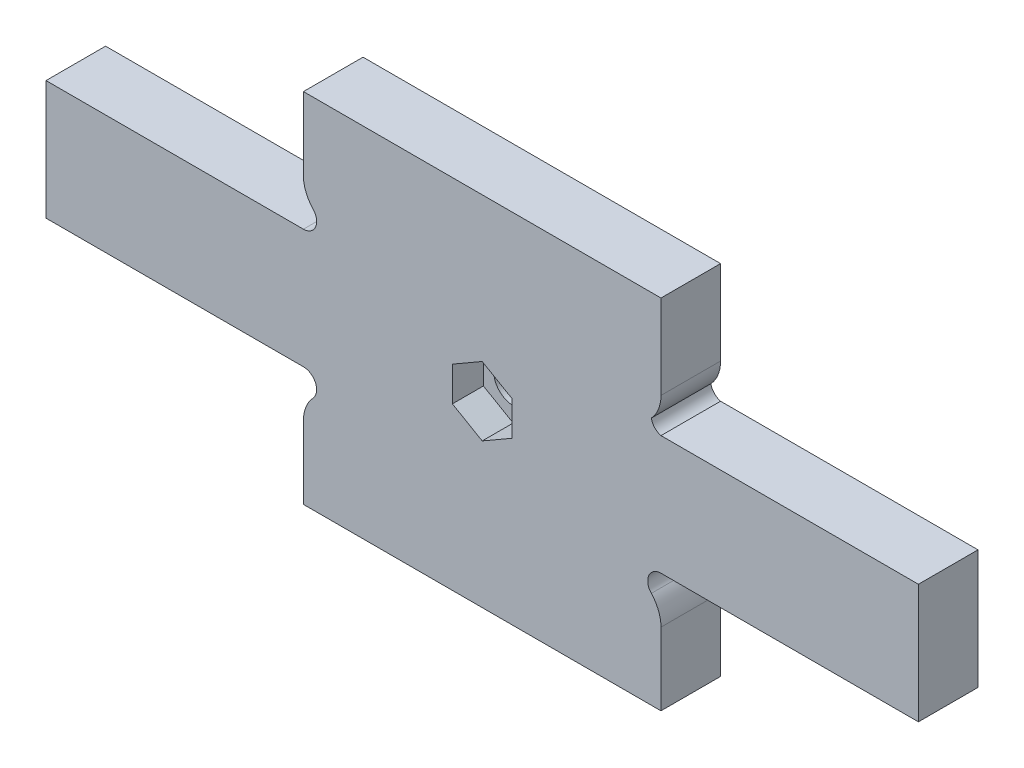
ISO-10303-21;
HEADER;
FILE_DESCRIPTION(('STEP AP214'),'2;1');
FILE_NAME('part.step','',(''),(''),'','','');
FILE_SCHEMA(('AUTOMOTIVE_DESIGN { 1 0 10303 214 1 1 1 1 }'));
ENDSEC;
DATA;
#1=APPLICATION_CONTEXT('core data for automotive mechanical design processes');
#2=APPLICATION_PROTOCOL_DEFINITION('international standard','automotive_design',2000,#1);
#3=PRODUCT_CONTEXT('',#1,'mechanical');
#4=PRODUCT('Part','Part','',(#3));
#5=PRODUCT_RELATED_PRODUCT_CATEGORY('part','',(#4));
#6=PRODUCT_DEFINITION_FORMATION('','',#4);
#7=PRODUCT_DEFINITION_CONTEXT('part definition',#1,'design');
#8=PRODUCT_DEFINITION('design','',#6,#7);
#9=PRODUCT_DEFINITION_SHAPE('','',#8);
#10=(LENGTH_UNIT() NAMED_UNIT(*) SI_UNIT(.MILLI.,.METRE.));
#11=(NAMED_UNIT(*) PLANE_ANGLE_UNIT() SI_UNIT($,.RADIAN.));
#12=(NAMED_UNIT(*) SI_UNIT($,.STERADIAN.) SOLID_ANGLE_UNIT());
#13=UNCERTAINTY_MEASURE_WITH_UNIT(LENGTH_MEASURE(1.E-05),#10,'distance_accuracy_value','');
#14=(GEOMETRIC_REPRESENTATION_CONTEXT(3) GLOBAL_UNCERTAINTY_ASSIGNED_CONTEXT((#13)) GLOBAL_UNIT_ASSIGNED_CONTEXT((#10,
#11,#12)) REPRESENTATION_CONTEXT('',''));
#15=CARTESIAN_POINT('',(0.,0.,0.));
#16=DIRECTION('',(0.,0.,1.));
#17=DIRECTION('',(1.,0.,0.));
#18=AXIS2_PLACEMENT_3D('',#15,#16,#17);
#19=CARTESIAN_POINT('',(0.,0.,0.));
#20=DIRECTION('',(0.,0.,1.));
#21=DIRECTION('',(1.,0.,0.));
#22=AXIS2_PLACEMENT_3D('',#19,#20,#21);
#23=CYLINDRICAL_SURFACE('',#22,3.25);
#24=CARTESIAN_POINT('',(0.,0.,0.));
#25=DIRECTION('',(0.,0.,1.));
#26=DIRECTION('',(1.,0.,0.));
#27=AXIS2_PLACEMENT_3D('',#24,#25,#26);
#28=CIRCLE('',#27,3.25);
#29=CARTESIAN_POINT('',(3.25,0.,0.));
#30=VERTEX_POINT('',#29);
#31=EDGE_CURVE('E237',#30,#30,#28,.T.);
#32=ORIENTED_EDGE('',*,*,#31,.F.);
#33=EDGE_LOOP('',(#32));
#34=FACE_BOUND('',#33,.T.);
#35=CARTESIAN_POINT('',(0.,0.,4.8));
#36=DIRECTION('',(0.,0.,1.));
#37=DIRECTION('',(1.,0.,0.));
#38=AXIS2_PLACEMENT_3D('',#35,#36,#37);
#39=CIRCLE('',#38,3.25);
#40=CARTESIAN_POINT('',(3.25,0.,4.8));
#41=VERTEX_POINT('',#40);
#42=EDGE_CURVE('E49',#41,#41,#39,.F.);
#43=ORIENTED_EDGE('',*,*,#42,.F.);
#44=EDGE_LOOP('',(#43));
#45=FACE_BOUND('',#44,.T.);
#46=ADVANCED_FACE('F45',(#34,#45),#23,.F.);
#47=CARTESIAN_POINT('',(30.0000000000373,-12.2200000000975,10.));
#48=DIRECTION('',(0.,0.,-1.));
#49=DIRECTION('',(-1.,0.,0.));
#50=AXIS2_PLACEMENT_3D('',#47,#48,#49);
#51=CYLINDRICAL_SURFACE('',#50,2.22000000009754);
#52=CARTESIAN_POINT('',(30.0000000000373,-12.2200000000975,0.));
#53=DIRECTION('',(0.,0.,-1.));
#54=DIRECTION('',(1.,0.,0.));
#55=AXIS2_PLACEMENT_3D('',#52,#53,#54);
#56=CIRCLE('',#55,2.22000000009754);
#57=CARTESIAN_POINT('',(28.3795620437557,-13.7374257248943,0.));
#58=VERTEX_POINT('',#57);
#59=CARTESIAN_POINT('',(30.0000000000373,-10.,0.));
#60=VERTEX_POINT('',#59);
#61=EDGE_CURVE('E232',#58,#60,#56,.T.);
#62=ORIENTED_EDGE('',*,*,#61,.T.);
#63=DIRECTION('',(0.,0.,-1.));
#64=VECTOR('',#63,1.);
#65=CARTESIAN_POINT('',(30.0000000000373,-10.,10.));
#66=LINE('',#65,#64);
#67=CARTESIAN_POINT('',(30.0000000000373,-10.,10.));
#68=VERTEX_POINT('',#67);
#69=EDGE_CURVE('E11',#68,#60,#66,.T.);
#70=ORIENTED_EDGE('',*,*,#69,.F.);
#71=CARTESIAN_POINT('',(30.0000000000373,-12.2200000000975,10.));
#72=DIRECTION('',(0.,0.,-1.));
#73=DIRECTION('',(1.,0.,0.));
#74=AXIS2_PLACEMENT_3D('',#71,#72,#73);
#75=CIRCLE('',#74,2.22000000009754);
#76=CARTESIAN_POINT('',(28.3795620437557,-13.7374257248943,10.));
#77=VERTEX_POINT('',#76);
#78=EDGE_CURVE('E292',#77,#68,#75,.T.);
#79=ORIENTED_EDGE('',*,*,#78,.F.);
#80=DIRECTION('',(0.,0.,-1.));
#81=VECTOR('',#80,1.);
#82=CARTESIAN_POINT('',(28.3795620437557,-13.7374257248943,10.));
#83=LINE('',#82,#81);
#84=EDGE_CURVE('E228',#77,#58,#83,.T.);
#85=ORIENTED_EDGE('',*,*,#84,.T.);
#86=EDGE_LOOP('',(#62,#70,#79,#85));
#87=FACE_BOUND('',#86,.T.);
#88=ADVANCED_FACE('F47',(#87),#51,.F.);
#89=CARTESIAN_POINT('',(30.0000000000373,-10.,10.));
#90=DIRECTION('',(0.,1.,0.));
#91=DIRECTION('',(-1.,0.,0.));
#92=AXIS2_PLACEMENT_3D('',#89,#90,#91);
#93=PLANE('',#92);
#94=DIRECTION('',(1.,0.,0.));
#95=VECTOR('',#94,1.);
#96=CARTESIAN_POINT('',(30.0000000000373,-10.,0.));
#97=LINE('',#96,#95);
#98=CARTESIAN_POINT('',(73.2000000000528,-9.99999999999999,0.));
#99=VERTEX_POINT('',#98);
#100=EDGE_CURVE('E236',#60,#99,#97,.T.);
#101=ORIENTED_EDGE('',*,*,#100,.T.);
#102=DIRECTION('',(0.,0.,-1.));
#103=VECTOR('',#102,1.);
#104=CARTESIAN_POINT('',(73.2000000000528,-9.99999999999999,10.));
#105=LINE('',#104,#103);
#106=CARTESIAN_POINT('',(73.2000000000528,-9.99999999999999,10.));
#107=VERTEX_POINT('',#106);
#108=EDGE_CURVE('E55',#107,#99,#105,.T.);
#109=ORIENTED_EDGE('',*,*,#108,.F.);
#110=DIRECTION('',(1.,0.,0.));
#111=VECTOR('',#110,1.);
#112=CARTESIAN_POINT('',(30.0000000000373,-10.,10.));
#113=LINE('',#112,#111);
#114=EDGE_CURVE('E148',#68,#107,#113,.T.);
#115=ORIENTED_EDGE('',*,*,#114,.F.);
#116=ORIENTED_EDGE('',*,*,#69,.T.);
#117=EDGE_LOOP('',(#101,#109,#115,#116));
#118=FACE_BOUND('',#117,.T.);
#119=ADVANCED_FACE('F574',(#118),#93,.F.);
#120=CARTESIAN_POINT('',(73.2000000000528,-9.99999999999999,10.));
#121=DIRECTION('',(-1.,0.,0.));
#122=DIRECTION('',(0.,0.,1.));
#123=AXIS2_PLACEMENT_3D('',#120,#121,#122);
#124=PLANE('',#123);
#125=DIRECTION('',(0.,1.,0.));
#126=VECTOR('',#125,1.);
#127=CARTESIAN_POINT('',(73.2000000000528,-9.99999999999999,0.));
#128=LINE('',#127,#126);
#129=CARTESIAN_POINT('',(73.2000000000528,10.,0.));
#130=VERTEX_POINT('',#129);
#131=EDGE_CURVE('E240',#99,#130,#128,.T.);
#132=ORIENTED_EDGE('',*,*,#131,.T.);
#133=DIRECTION('',(0.,0.,-1.));
#134=VECTOR('',#133,1.);
#135=CARTESIAN_POINT('',(73.2000000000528,10.,10.));
#136=LINE('',#135,#134);
#137=CARTESIAN_POINT('',(73.2000000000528,10.,10.));
#138=VERTEX_POINT('',#137);
#139=EDGE_CURVE('E351',#138,#130,#136,.T.);
#140=ORIENTED_EDGE('',*,*,#139,.F.);
#141=DIRECTION('',(0.,1.,0.));
#142=VECTOR('',#141,1.);
#143=CARTESIAN_POINT('',(73.2000000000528,-9.99999999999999,10.));
#144=LINE('',#143,#142);
#145=EDGE_CURVE('E362',#107,#138,#144,.T.);
#146=ORIENTED_EDGE('',*,*,#145,.F.);
#147=ORIENTED_EDGE('',*,*,#108,.T.);
#148=EDGE_LOOP('',(#132,#140,#146,#147));
#149=FACE_BOUND('',#148,.T.);
#150=ADVANCED_FACE('F360',(#149),#124,.F.);
#151=CARTESIAN_POINT('',(73.2000000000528,10.,10.));
#152=DIRECTION('',(0.,-1.,0.));
#153=DIRECTION('',(1.,0.,0.));
#154=AXIS2_PLACEMENT_3D('',#151,#152,#153);
#155=PLANE('',#154);
#156=DIRECTION('',(-1.,0.,0.));
#157=VECTOR('',#156,1.);
#158=CARTESIAN_POINT('',(73.2000000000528,10.,0.));
#159=LINE('',#158,#157);
#160=CARTESIAN_POINT('',(30.0000000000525,10.,0.));
#161=VERTEX_POINT('',#160);
#162=EDGE_CURVE('E243',#130,#161,#159,.T.);
#163=ORIENTED_EDGE('',*,*,#162,.T.);
#164=DIRECTION('',(0.,0.,-1.));
#165=VECTOR('',#164,1.);
#166=CARTESIAN_POINT('',(30.0000000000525,10.,10.));
#167=LINE('',#166,#165);
#168=CARTESIAN_POINT('',(30.0000000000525,10.,10.));
#169=VERTEX_POINT('',#168);
#170=EDGE_CURVE('E347',#169,#161,#167,.T.);
#171=ORIENTED_EDGE('',*,*,#170,.F.);
#172=DIRECTION('',(-1.,0.,0.));
#173=VECTOR('',#172,1.);
#174=CARTESIAN_POINT('',(73.2000000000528,10.,10.));
#175=LINE('',#174,#173);
#176=EDGE_CURVE('E381',#138,#169,#175,.T.);
#177=ORIENTED_EDGE('',*,*,#176,.F.);
#178=ORIENTED_EDGE('',*,*,#139,.T.);
#179=EDGE_LOOP('',(#163,#171,#177,#178));
#180=FACE_BOUND('',#179,.T.);
#181=ADVANCED_FACE('F371',(#180),#155,.F.);
#182=CARTESIAN_POINT('',(30.5612892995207,12.1478720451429,10.));
#183=DIRECTION('',(0.,0.,-1.));
#184=DIRECTION('',(-1.,0.,0.));
#185=AXIS2_PLACEMENT_3D('',#182,#183,#184);
#186=CYLINDRICAL_SURFACE('',#185,2.22000000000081);
#187=CARTESIAN_POINT('',(30.5612892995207,12.1478720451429,0.));
#188=DIRECTION('',(0.,0.,-1.));
#189=DIRECTION('',(1.,0.,0.));
#190=AXIS2_PLACEMENT_3D('',#187,#188,#189);
#191=CIRCLE('',#190,2.22000000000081);
#192=CARTESIAN_POINT('',(28.3795620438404,11.7374257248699,0.));
#193=VERTEX_POINT('',#192);
#194=EDGE_CURVE('E246',#161,#193,#191,.T.);
#195=ORIENTED_EDGE('',*,*,#194,.T.);
#196=DIRECTION('',(0.,0.,-1.));
#197=VECTOR('',#196,1.);
#198=CARTESIAN_POINT('',(28.3795620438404,11.7374257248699,10.));
#199=LINE('',#198,#197);
#200=CARTESIAN_POINT('',(28.3795620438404,11.7374257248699,10.));
#201=VERTEX_POINT('',#200);
#202=EDGE_CURVE('E343',#201,#193,#199,.T.);
#203=ORIENTED_EDGE('',*,*,#202,.F.);
#204=CARTESIAN_POINT('',(30.5612892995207,12.1478720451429,10.));
#205=DIRECTION('',(0.,0.,-1.));
#206=DIRECTION('',(1.,0.,0.));
#207=AXIS2_PLACEMENT_3D('',#204,#205,#206);
#208=CIRCLE('',#207,2.22000000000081);
#209=EDGE_CURVE('E377',#169,#201,#208,.T.);
#210=ORIENTED_EDGE('',*,*,#209,.F.);
#211=ORIENTED_EDGE('',*,*,#170,.T.);
#212=EDGE_LOOP('',(#195,#203,#210,#211));
#213=FACE_BOUND('',#212,.T.);
#214=ADVANCED_FACE('F375',(#213),#186,.F.);
#215=CARTESIAN_POINT('',(24.0000000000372,15.8385763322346,10.));
#216=DIRECTION('',(0.,0.,-1.));
#217=DIRECTION('',(-1.,0.,0.));
#218=AXIS2_PLACEMENT_3D('',#215,#216,#217);
#219=CYLINDRICAL_SURFACE('',#218,5.99999999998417);
#220=CARTESIAN_POINT('',(24.0000000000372,15.8385763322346,0.));
#221=DIRECTION('',(0.,0.,1.));
#222=DIRECTION('',(1.,0.,0.));
#223=AXIS2_PLACEMENT_3D('',#220,#221,#222);
#224=CIRCLE('',#223,5.99999999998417);
#225=CARTESIAN_POINT('',(30.0000000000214,15.8385763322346,0.));
#226=VERTEX_POINT('',#225);
#227=EDGE_CURVE('E249',#193,#226,#224,.T.);
#228=ORIENTED_EDGE('',*,*,#227,.T.);
#229=DIRECTION('',(0.,0.,-1.));
#230=VECTOR('',#229,1.);
#231=CARTESIAN_POINT('',(30.0000000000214,15.8385763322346,10.));
#232=LINE('',#231,#230);
#233=CARTESIAN_POINT('',(30.0000000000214,15.8385763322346,10.));
#234=VERTEX_POINT('',#233);
#235=EDGE_CURVE('E339',#234,#226,#232,.T.);
#236=ORIENTED_EDGE('',*,*,#235,.F.);
#237=CARTESIAN_POINT('',(24.0000000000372,15.8385763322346,10.));
#238=DIRECTION('',(0.,0.,1.));
#239=DIRECTION('',(1.,0.,0.));
#240=AXIS2_PLACEMENT_3D('',#237,#238,#239);
#241=CIRCLE('',#240,5.99999999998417);
#242=EDGE_CURVE('E380',#201,#234,#241,.T.);
#243=ORIENTED_EDGE('',*,*,#242,.F.);
#244=ORIENTED_EDGE('',*,*,#202,.T.);
#245=EDGE_LOOP('',(#228,#236,#243,#244));
#246=FACE_BOUND('',#245,.T.);
#247=ADVANCED_FACE('F628',(#246),#219,.T.);
#248=CARTESIAN_POINT('',(30.0000000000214,15.8385763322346,10.));
#249=DIRECTION('',(-1.,0.,0.));
#250=DIRECTION('',(0.,0.,1.));
#251=AXIS2_PLACEMENT_3D('',#248,#249,#250);
#252=PLANE('',#251);
#253=DIRECTION('',(0.,1.,0.));
#254=VECTOR('',#253,1.);
#255=CARTESIAN_POINT('',(30.0000000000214,15.8385763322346,0.));
#256=LINE('',#255,#254);
#257=CARTESIAN_POINT('',(30.0000000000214,30.,0.));
#258=VERTEX_POINT('',#257);
#259=EDGE_CURVE('E252',#226,#258,#256,.T.);
#260=ORIENTED_EDGE('',*,*,#259,.T.);
#261=DIRECTION('',(0.,0.,-1.));
#262=VECTOR('',#261,1.);
#263=CARTESIAN_POINT('',(30.0000000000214,30.,10.));
#264=LINE('',#263,#262);
#265=CARTESIAN_POINT('',(30.0000000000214,30.,10.));
#266=VERTEX_POINT('',#265);
#267=EDGE_CURVE('E335',#266,#258,#264,.T.);
#268=ORIENTED_EDGE('',*,*,#267,.F.);
#269=DIRECTION('',(0.,1.,0.));
#270=VECTOR('',#269,1.);
#271=CARTESIAN_POINT('',(30.0000000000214,15.8385763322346,10.));
#272=LINE('',#271,#270);
#273=EDGE_CURVE('E385',#234,#266,#272,.T.);
#274=ORIENTED_EDGE('',*,*,#273,.F.);
#275=ORIENTED_EDGE('',*,*,#235,.T.);
#276=EDGE_LOOP('',(#260,#268,#274,#275));
#277=FACE_BOUND('',#276,.T.);
#278=ADVANCED_FACE('F624',(#277),#252,.F.);
#279=CARTESIAN_POINT('',(30.0000000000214,30.,10.));
#280=DIRECTION('',(0.,-1.,0.));
#281=DIRECTION('',(0.,0.,-1.));
#282=AXIS2_PLACEMENT_3D('',#279,#280,#281);
#283=PLANE('',#282);
#284=DIRECTION('',(-1.,0.,0.));
#285=VECTOR('',#284,1.);
#286=CARTESIAN_POINT('',(30.0000000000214,30.,0.));
#287=LINE('',#286,#285);
#288=CARTESIAN_POINT('',(-30.,30.,0.));
#289=VERTEX_POINT('',#288);
#290=EDGE_CURVE('E255',#258,#289,#287,.T.);
#291=ORIENTED_EDGE('',*,*,#290,.T.);
#292=DIRECTION('',(0.,0.,-1.));
#293=VECTOR('',#292,1.);
#294=CARTESIAN_POINT('',(-30.,30.,10.));
#295=LINE('',#294,#293);
#296=CARTESIAN_POINT('',(-30.,30.,10.));
#297=VERTEX_POINT('',#296);
#298=EDGE_CURVE('E331',#297,#289,#295,.T.);
#299=ORIENTED_EDGE('',*,*,#298,.F.);
#300=DIRECTION('',(-1.,0.,0.));
#301=VECTOR('',#300,1.);
#302=CARTESIAN_POINT('',(30.0000000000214,30.,10.));
#303=LINE('',#302,#301);
#304=EDGE_CURVE('E392',#266,#297,#303,.T.);
#305=ORIENTED_EDGE('',*,*,#304,.F.);
#306=ORIENTED_EDGE('',*,*,#267,.T.);
#307=EDGE_LOOP('',(#291,#299,#305,#306));
#308=FACE_BOUND('',#307,.T.);
#309=ADVANCED_FACE('F620',(#308),#283,.F.);
#310=CARTESIAN_POINT('',(-30.,30.,10.));
#311=DIRECTION('',(1.,0.,0.));
#312=DIRECTION('',(0.,0.,-1.));
#313=AXIS2_PLACEMENT_3D('',#310,#311,#312);
#314=PLANE('',#313);
#315=DIRECTION('',(0.,-1.,0.));
#316=VECTOR('',#315,1.);
#317=CARTESIAN_POINT('',(-30.,30.,0.));
#318=LINE('',#317,#316);
#319=CARTESIAN_POINT('',(-30.,17.3740036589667,0.));
#320=VERTEX_POINT('',#319);
#321=EDGE_CURVE('E258',#289,#320,#318,.T.);
#322=ORIENTED_EDGE('',*,*,#321,.T.);
#323=DIRECTION('',(0.,0.,-1.));
#324=VECTOR('',#323,1.);
#325=CARTESIAN_POINT('',(-30.,17.3740036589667,10.));
#326=LINE('',#325,#324);
#327=CARTESIAN_POINT('',(-30.,17.3740036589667,10.));
#328=VERTEX_POINT('',#327);
#329=EDGE_CURVE('E327',#328,#320,#326,.T.);
#330=ORIENTED_EDGE('',*,*,#329,.F.);
#331=DIRECTION('',(0.,-1.,0.));
#332=VECTOR('',#331,1.);
#333=CARTESIAN_POINT('',(-30.,30.,10.));
#334=LINE('',#333,#332);
#335=EDGE_CURVE('E395',#297,#328,#334,.T.);
#336=ORIENTED_EDGE('',*,*,#335,.F.);
#337=ORIENTED_EDGE('',*,*,#298,.T.);
#338=EDGE_LOOP('',(#322,#330,#336,#337));
#339=FACE_BOUND('',#338,.T.);
#340=ADVANCED_FACE('F616',(#339),#314,.F.);
#341=CARTESIAN_POINT('',(-24.0196732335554,17.8594846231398,10.));
#342=DIRECTION('',(0.,0.,-1.));
#343=DIRECTION('',(-1.,0.,0.));
#344=AXIS2_PLACEMENT_3D('',#341,#342,#343);
#345=CYLINDRICAL_SURFACE('',#344,6.00000000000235);
#346=CARTESIAN_POINT('',(-24.0196732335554,17.8594846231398,0.));
#347=DIRECTION('',(0.,0.,1.));
#348=DIRECTION('',(1.,0.,0.));
#349=AXIS2_PLACEMENT_3D('',#346,#347,#348);
#350=CIRCLE('',#349,6.00000000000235);
#351=CARTESIAN_POINT('',(-28.3795620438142,13.7374257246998,0.));
#352=VERTEX_POINT('',#351);
#353=EDGE_CURVE('E261',#320,#352,#350,.T.);
#354=ORIENTED_EDGE('',*,*,#353,.T.);
#355=DIRECTION('',(0.,0.,-1.));
#356=VECTOR('',#355,1.);
#357=CARTESIAN_POINT('',(-28.3795620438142,13.7374257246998,10.));
#358=LINE('',#357,#356);
#359=CARTESIAN_POINT('',(-28.3795620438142,13.7374257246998,10.));
#360=VERTEX_POINT('',#359);
#361=EDGE_CURVE('E323',#360,#352,#358,.T.);
#362=ORIENTED_EDGE('',*,*,#361,.F.);
#363=CARTESIAN_POINT('',(-24.0196732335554,17.8594846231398,10.));
#364=DIRECTION('',(0.,0.,1.));
#365=DIRECTION('',(1.,0.,0.));
#366=AXIS2_PLACEMENT_3D('',#363,#364,#365);
#367=CIRCLE('',#366,6.00000000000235);
#368=EDGE_CURVE('E398',#328,#360,#367,.T.);
#369=ORIENTED_EDGE('',*,*,#368,.F.);
#370=ORIENTED_EDGE('',*,*,#329,.T.);
#371=EDGE_LOOP('',(#354,#362,#369,#370));
#372=FACE_BOUND('',#371,.T.);
#373=ADVANCED_FACE('F612',(#372),#345,.T.);
#374=CARTESIAN_POINT('',(-30.000000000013,12.2199999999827,10.));
#375=DIRECTION('',(0.,0.,-1.));
#376=DIRECTION('',(-1.,0.,0.));
#377=AXIS2_PLACEMENT_3D('',#374,#375,#376);
#378=CYLINDRICAL_SURFACE('',#377,2.21999999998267);
#379=CARTESIAN_POINT('',(-30.000000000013,12.2199999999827,0.));
#380=DIRECTION('',(0.,0.,-1.));
#381=DIRECTION('',(1.,0.,0.));
#382=AXIS2_PLACEMENT_3D('',#379,#380,#381);
#383=CIRCLE('',#382,2.21999999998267);
#384=CARTESIAN_POINT('',(-30.000000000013,10.,0.));
#385=VERTEX_POINT('',#384);
#386=EDGE_CURVE('E264',#352,#385,#383,.T.);
#387=ORIENTED_EDGE('',*,*,#386,.T.);
#388=DIRECTION('',(0.,0.,-1.));
#389=VECTOR('',#388,1.);
#390=CARTESIAN_POINT('',(-30.000000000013,10.,10.));
#391=LINE('',#390,#389);
#392=CARTESIAN_POINT('',(-30.000000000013,10.,10.));
#393=VERTEX_POINT('',#392);
#394=EDGE_CURVE('E319',#393,#385,#391,.T.);
#395=ORIENTED_EDGE('',*,*,#394,.F.);
#396=CARTESIAN_POINT('',(-30.000000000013,12.2199999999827,10.));
#397=DIRECTION('',(0.,0.,-1.));
#398=DIRECTION('',(1.,0.,0.));
#399=AXIS2_PLACEMENT_3D('',#396,#397,#398);
#400=CIRCLE('',#399,2.21999999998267);
#401=EDGE_CURVE('E401',#360,#393,#400,.T.);
#402=ORIENTED_EDGE('',*,*,#401,.F.);
#403=ORIENTED_EDGE('',*,*,#361,.T.);
#404=EDGE_LOOP('',(#387,#395,#402,#403));
#405=FACE_BOUND('',#404,.T.);
#406=ADVANCED_FACE('F608',(#405),#378,.F.);
#407=CARTESIAN_POINT('',(-30.000000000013,10.,10.));
#408=DIRECTION('',(0.,-1.,0.));
#409=DIRECTION('',(0.,0.,-1.));
#410=AXIS2_PLACEMENT_3D('',#407,#408,#409);
#411=PLANE('',#410);
#412=DIRECTION('',(-1.,0.,0.));
#413=VECTOR('',#412,1.);
#414=CARTESIAN_POINT('',(-30.000000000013,10.,0.));
#415=LINE('',#414,#413);
#416=CARTESIAN_POINT('',(-73.2000000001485,10.,0.));
#417=VERTEX_POINT('',#416);
#418=EDGE_CURVE('E267',#385,#417,#415,.T.);
#419=ORIENTED_EDGE('',*,*,#418,.T.);
#420=DIRECTION('',(0.,0.,-1.));
#421=VECTOR('',#420,1.);
#422=CARTESIAN_POINT('',(-73.2000000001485,10.,10.));
#423=LINE('',#422,#421);
#424=CARTESIAN_POINT('',(-73.2000000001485,10.,10.));
#425=VERTEX_POINT('',#424);
#426=EDGE_CURVE('E315',#425,#417,#423,.T.);
#427=ORIENTED_EDGE('',*,*,#426,.F.);
#428=DIRECTION('',(-1.,0.,0.));
#429=VECTOR('',#428,1.);
#430=CARTESIAN_POINT('',(-30.000000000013,10.,10.));
#431=LINE('',#430,#429);
#432=EDGE_CURVE('E404',#393,#425,#431,.T.);
#433=ORIENTED_EDGE('',*,*,#432,.F.);
#434=ORIENTED_EDGE('',*,*,#394,.T.);
#435=EDGE_LOOP('',(#419,#427,#433,#434));
#436=FACE_BOUND('',#435,.T.);
#437=ADVANCED_FACE('F604',(#436),#411,.F.);
#438=CARTESIAN_POINT('',(-73.2000000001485,10.,10.));
#439=DIRECTION('',(1.,0.,0.));
#440=DIRECTION('',(0.,1.,0.));
#441=AXIS2_PLACEMENT_3D('',#438,#439,#440);
#442=PLANE('',#441);
#443=DIRECTION('',(0.,-1.,0.));
#444=VECTOR('',#443,1.);
#445=CARTESIAN_POINT('',(-73.2000000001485,10.,0.));
#446=LINE('',#445,#444);
#447=CARTESIAN_POINT('',(-73.2000000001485,-10.,0.));
#448=VERTEX_POINT('',#447);
#449=EDGE_CURVE('E270',#417,#448,#446,.T.);
#450=ORIENTED_EDGE('',*,*,#449,.T.);
#451=DIRECTION('',(0.,0.,-1.));
#452=VECTOR('',#451,1.);
#453=CARTESIAN_POINT('',(-73.2000000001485,-10.,10.));
#454=LINE('',#453,#452);
#455=CARTESIAN_POINT('',(-73.2000000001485,-10.,10.));
#456=VERTEX_POINT('',#455);
#457=EDGE_CURVE('E311',#456,#448,#454,.T.);
#458=ORIENTED_EDGE('',*,*,#457,.F.);
#459=DIRECTION('',(0.,-1.,0.));
#460=VECTOR('',#459,1.);
#461=CARTESIAN_POINT('',(-73.2000000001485,10.,10.));
#462=LINE('',#461,#460);
#463=EDGE_CURVE('E407',#425,#456,#462,.T.);
#464=ORIENTED_EDGE('',*,*,#463,.F.);
#465=ORIENTED_EDGE('',*,*,#426,.T.);
#466=EDGE_LOOP('',(#450,#458,#464,#465));
#467=FACE_BOUND('',#466,.T.);
#468=ADVANCED_FACE('F600',(#467),#442,.F.);
#469=CARTESIAN_POINT('',(-73.2000000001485,-10.,10.));
#470=DIRECTION('',(0.,1.,0.));
#471=DIRECTION('',(-1.,0.,0.));
#472=AXIS2_PLACEMENT_3D('',#469,#470,#471);
#473=PLANE('',#472);
#474=DIRECTION('',(1.,0.,0.));
#475=VECTOR('',#474,1.);
#476=CARTESIAN_POINT('',(-73.2000000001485,-10.,0.));
#477=LINE('',#476,#475);
#478=CARTESIAN_POINT('',(-30.000000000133,-9.99999999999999,0.));
#479=VERTEX_POINT('',#478);
#480=EDGE_CURVE('E273',#448,#479,#477,.T.);
#481=ORIENTED_EDGE('',*,*,#480,.T.);
#482=DIRECTION('',(0.,0.,-1.));
#483=VECTOR('',#482,1.);
#484=CARTESIAN_POINT('',(-30.000000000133,-9.99999999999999,10.));
#485=LINE('',#484,#483);
#486=CARTESIAN_POINT('',(-30.000000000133,-9.99999999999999,10.));
#487=VERTEX_POINT('',#486);
#488=EDGE_CURVE('E307',#487,#479,#485,.T.);
#489=ORIENTED_EDGE('',*,*,#488,.F.);
#490=DIRECTION('',(1.,0.,0.));
#491=VECTOR('',#490,1.);
#492=CARTESIAN_POINT('',(-73.2000000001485,-10.,10.));
#493=LINE('',#492,#491);
#494=EDGE_CURVE('E410',#456,#487,#493,.T.);
#495=ORIENTED_EDGE('',*,*,#494,.F.);
#496=ORIENTED_EDGE('',*,*,#457,.T.);
#497=EDGE_LOOP('',(#481,#489,#495,#496));
#498=FACE_BOUND('',#497,.T.);
#499=ADVANCED_FACE('F596',(#498),#473,.F.);
#500=CARTESIAN_POINT('',(-30.000000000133,-12.2200000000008,10.));
#501=DIRECTION('',(0.,0.,-1.));
#502=DIRECTION('',(-1.,0.,0.));
#503=AXIS2_PLACEMENT_3D('',#500,#501,#502);
#504=CYLINDRICAL_SURFACE('',#503,2.22000000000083);
#505=CARTESIAN_POINT('',(-30.000000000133,-12.2200000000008,0.));
#506=DIRECTION('',(0.,0.,-1.));
#507=DIRECTION('',(1.,0.,0.));
#508=AXIS2_PLACEMENT_3D('',#505,#506,#507);
#509=CIRCLE('',#508,2.22000000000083);
#510=CARTESIAN_POINT('',(-28.3795620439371,-13.7374257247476,0.));
#511=VERTEX_POINT('',#510);
#512=EDGE_CURVE('E276',#479,#511,#509,.T.);
#513=ORIENTED_EDGE('',*,*,#512,.T.);
#514=DIRECTION('',(0.,0.,-1.));
#515=VECTOR('',#514,1.);
#516=CARTESIAN_POINT('',(-28.3795620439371,-13.7374257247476,10.));
#517=LINE('',#516,#515);
#518=CARTESIAN_POINT('',(-28.3795620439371,-13.7374257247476,10.));
#519=VERTEX_POINT('',#518);
#520=EDGE_CURVE('E303',#519,#511,#517,.T.);
#521=ORIENTED_EDGE('',*,*,#520,.F.);
#522=CARTESIAN_POINT('',(-30.000000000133,-12.2200000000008,10.));
#523=DIRECTION('',(0.,0.,-1.));
#524=DIRECTION('',(1.,0.,0.));
#525=AXIS2_PLACEMENT_3D('',#522,#523,#524);
#526=CIRCLE('',#525,2.22000000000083);
#527=EDGE_CURVE('E413',#487,#519,#526,.T.);
#528=ORIENTED_EDGE('',*,*,#527,.F.);
#529=ORIENTED_EDGE('',*,*,#488,.T.);
#530=EDGE_LOOP('',(#513,#521,#528,#529));
#531=FACE_BOUND('',#530,.T.);
#532=ADVANCED_FACE('F593',(#531),#504,.F.);
#533=CARTESIAN_POINT('',(-24.0000000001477,-17.8385763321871,10.));
#534=DIRECTION('',(0.,0.,-1.));
#535=DIRECTION('',(-1.,0.,0.));
#536=AXIS2_PLACEMENT_3D('',#533,#534,#535);
#537=CYLINDRICAL_SURFACE('',#536,6.00000000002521);
#538=CARTESIAN_POINT('',(-24.0000000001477,-17.8385763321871,0.));
#539=DIRECTION('',(0.,0.,1.));
#540=DIRECTION('',(1.,0.,0.));
#541=AXIS2_PLACEMENT_3D('',#538,#539,#540);
#542=CIRCLE('',#541,6.00000000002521);
#543=CARTESIAN_POINT('',(-30.0000000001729,-17.8385763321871,0.));
#544=VERTEX_POINT('',#543);
#545=EDGE_CURVE('E279',#511,#544,#542,.T.);
#546=ORIENTED_EDGE('',*,*,#545,.T.);
#547=DIRECTION('',(0.,0.,-1.));
#548=VECTOR('',#547,1.);
#549=CARTESIAN_POINT('',(-30.0000000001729,-17.8385763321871,10.));
#550=LINE('',#549,#548);
#551=CARTESIAN_POINT('',(-30.0000000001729,-17.8385763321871,10.));
#552=VERTEX_POINT('',#551);
#553=EDGE_CURVE('E299',#552,#544,#550,.T.);
#554=ORIENTED_EDGE('',*,*,#553,.F.);
#555=CARTESIAN_POINT('',(-24.0000000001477,-17.8385763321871,10.));
#556=DIRECTION('',(0.,0.,1.));
#557=DIRECTION('',(1.,0.,0.));
#558=AXIS2_PLACEMENT_3D('',#555,#556,#557);
#559=CIRCLE('',#558,6.00000000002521);
#560=EDGE_CURVE('E416',#519,#552,#559,.T.);
#561=ORIENTED_EDGE('',*,*,#560,.F.);
#562=ORIENTED_EDGE('',*,*,#520,.T.);
#563=EDGE_LOOP('',(#546,#554,#561,#562));
#564=FACE_BOUND('',#563,.T.);
#565=ADVANCED_FACE('F424',(#564),#537,.T.);
#566=CARTESIAN_POINT('',(-30.0000000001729,-17.8385763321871,10.));
#567=DIRECTION('',(1.,0.,0.));
#568=DIRECTION('',(0.,0.,-1.));
#569=AXIS2_PLACEMENT_3D('',#566,#567,#568);
#570=PLANE('',#569);
#571=DIRECTION('',(0.,-1.,0.));
#572=VECTOR('',#571,1.);
#573=CARTESIAN_POINT('',(-30.0000000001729,-17.8385763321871,0.));
#574=LINE('',#573,#572);
#575=CARTESIAN_POINT('',(-30.0000000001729,-30.,0.));
#576=VERTEX_POINT('',#575);
#577=EDGE_CURVE('E282',#544,#576,#574,.T.);
#578=ORIENTED_EDGE('',*,*,#577,.T.);
#579=DIRECTION('',(0.,0.,-1.));
#580=VECTOR('',#579,1.);
#581=CARTESIAN_POINT('',(-30.0000000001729,-30.,10.));
#582=LINE('',#581,#580);
#583=CARTESIAN_POINT('',(-30.0000000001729,-30.,10.));
#584=VERTEX_POINT('',#583);
#585=EDGE_CURVE('E221',#584,#576,#582,.T.);
#586=ORIENTED_EDGE('',*,*,#585,.F.);
#587=DIRECTION('',(0.,-1.,0.));
#588=VECTOR('',#587,1.);
#589=CARTESIAN_POINT('',(-30.0000000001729,-17.8385763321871,10.));
#590=LINE('',#589,#588);
#591=EDGE_CURVE('E207',#552,#584,#590,.T.);
#592=ORIENTED_EDGE('',*,*,#591,.F.);
#593=ORIENTED_EDGE('',*,*,#553,.T.);
#594=EDGE_LOOP('',(#578,#586,#592,#593));
#595=FACE_BOUND('',#594,.T.);
#596=ADVANCED_FACE('F428',(#595),#570,.F.);
#597=CARTESIAN_POINT('',(-30.0000000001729,-30.,10.));
#598=DIRECTION('',(0.,1.,0.));
#599=DIRECTION('',(-1.,0.,0.));
#600=AXIS2_PLACEMENT_3D('',#597,#598,#599);
#601=PLANE('',#600);
#602=DIRECTION('',(1.,0.,0.));
#603=VECTOR('',#602,1.);
#604=CARTESIAN_POINT('',(-30.0000000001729,-30.,0.));
#605=LINE('',#604,#603);
#606=CARTESIAN_POINT('',(29.9999999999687,-30.,0.));
#607=VERTEX_POINT('',#606);
#608=EDGE_CURVE('E217',#576,#607,#605,.T.);
#609=ORIENTED_EDGE('',*,*,#608,.T.);
#610=DIRECTION('',(0.,0.,-1.));
#611=VECTOR('',#610,1.);
#612=CARTESIAN_POINT('',(29.9999999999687,-30.,10.));
#613=LINE('',#612,#611);
#614=CARTESIAN_POINT('',(29.9999999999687,-30.,10.));
#615=VERTEX_POINT('',#614);
#616=EDGE_CURVE('E214',#615,#607,#613,.T.);
#617=ORIENTED_EDGE('',*,*,#616,.F.);
#618=DIRECTION('',(1.,0.,0.));
#619=VECTOR('',#618,1.);
#620=CARTESIAN_POINT('',(-30.0000000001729,-30.,10.));
#621=LINE('',#620,#619);
#622=EDGE_CURVE('E200',#584,#615,#621,.T.);
#623=ORIENTED_EDGE('',*,*,#622,.F.);
#624=ORIENTED_EDGE('',*,*,#585,.T.);
#625=EDGE_LOOP('',(#609,#617,#623,#624));
#626=FACE_BOUND('',#625,.T.);
#627=ADVANCED_FACE('F215',(#626),#601,.F.);
#628=CARTESIAN_POINT('',(29.9999999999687,-30.,10.));
#629=DIRECTION('',(-1.,0.,0.));
#630=DIRECTION('',(0.,-1.,0.));
#631=AXIS2_PLACEMENT_3D('',#628,#629,#630);
#632=PLANE('',#631);
#633=DIRECTION('',(0.,1.,0.));
#634=VECTOR('',#633,1.);
#635=CARTESIAN_POINT('',(29.9999999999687,-30.,0.));
#636=LINE('',#635,#634);
#637=CARTESIAN_POINT('',(29.9999999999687,-17.8385763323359,0.));
#638=VERTEX_POINT('',#637);
#639=EDGE_CURVE('E287',#607,#638,#636,.T.);
#640=ORIENTED_EDGE('',*,*,#639,.T.);
#641=DIRECTION('',(0.,0.,-1.));
#642=VECTOR('',#641,1.);
#643=CARTESIAN_POINT('',(29.9999999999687,-17.8385763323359,10.));
#644=LINE('',#643,#642);
#645=CARTESIAN_POINT('',(29.9999999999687,-17.8385763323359,10.));
#646=VERTEX_POINT('',#645);
#647=EDGE_CURVE('E222',#646,#638,#644,.T.);
#648=ORIENTED_EDGE('',*,*,#647,.F.);
#649=DIRECTION('',(0.,1.,0.));
#650=VECTOR('',#649,1.);
#651=CARTESIAN_POINT('',(29.9999999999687,-30.,10.));
#652=LINE('',#651,#650);
#653=EDGE_CURVE('E204',#615,#646,#652,.T.);
#654=ORIENTED_EDGE('',*,*,#653,.F.);
#655=ORIENTED_EDGE('',*,*,#616,.T.);
#656=EDGE_LOOP('',(#640,#648,#654,#655));
#657=FACE_BOUND('',#656,.T.);
#658=ADVANCED_FACE('F224',(#657),#632,.F.);
#659=CARTESIAN_POINT('',(23.9999999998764,-17.8385763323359,10.));
#660=DIRECTION('',(0.,0.,-1.));
#661=DIRECTION('',(-1.,0.,0.));
#662=AXIS2_PLACEMENT_3D('',#659,#660,#661);
#663=CYLINDRICAL_SURFACE('',#662,6.00000000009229);
#664=CARTESIAN_POINT('',(23.9999999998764,-17.8385763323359,0.));
#665=DIRECTION('',(0.,0.,1.));
#666=DIRECTION('',(1.,0.,0.));
#667=AXIS2_PLACEMENT_3D('',#664,#665,#666);
#668=CIRCLE('',#667,6.00000000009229);
#669=EDGE_CURVE('E140',#638,#58,#668,.T.);
#670=ORIENTED_EDGE('',*,*,#669,.T.);
#671=ORIENTED_EDGE('',*,*,#84,.F.);
#672=CARTESIAN_POINT('',(23.9999999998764,-17.8385763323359,10.));
#673=DIRECTION('',(0.,0.,1.));
#674=DIRECTION('',(1.,0.,0.));
#675=AXIS2_PLACEMENT_3D('',#672,#673,#674);
#676=CIRCLE('',#675,6.00000000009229);
#677=EDGE_CURVE('E71',#646,#77,#676,.T.);
#678=ORIENTED_EDGE('',*,*,#677,.F.);
#679=ORIENTED_EDGE('',*,*,#647,.T.);
#680=EDGE_LOOP('',(#670,#671,#678,#679));
#681=FACE_BOUND('',#680,.T.);
#682=ADVANCED_FACE('F429',(#681),#663,.T.);
#683=CARTESIAN_POINT('',(30.0000000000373,-12.2200000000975,10.));
#684=DIRECTION('',(0.,0.,1.));
#685=DIRECTION('',(1.,0.,0.));
#686=AXIS2_PLACEMENT_3D('',#683,#684,#685);
#687=PLANE('',#686);
#688=DIRECTION('',(0.866025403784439,0.5,0.));
#689=VECTOR('',#688,1.);
#690=CARTESIAN_POINT('',(0.,-5.77350269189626,10.));
#691=LINE('',#690,#689);
#692=CARTESIAN_POINT('',(0.,-5.77350269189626,10.));
#693=VERTEX_POINT('',#692);
#694=CARTESIAN_POINT('',(5.,-2.88675134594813,10.));
#695=VERTEX_POINT('',#694);
#696=EDGE_CURVE('E62',#693,#695,#691,.T.);
#697=ORIENTED_EDGE('',*,*,#696,.F.);
#698=DIRECTION('',(0.866025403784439,-0.5,0.));
#699=VECTOR('',#698,1.);
#700=CARTESIAN_POINT('',(-5.,-2.88675134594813,10.));
#701=LINE('',#700,#699);
#702=CARTESIAN_POINT('',(-5.,-2.88675134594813,10.));
#703=VERTEX_POINT('',#702);
#704=EDGE_CURVE('E465',#703,#693,#701,.T.);
#705=ORIENTED_EDGE('',*,*,#704,.F.);
#706=DIRECTION('',(0.,-1.,0.));
#707=VECTOR('',#706,1.);
#708=CARTESIAN_POINT('',(-5.,2.88675134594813,10.));
#709=LINE('',#708,#707);
#710=CARTESIAN_POINT('',(-5.,2.88675134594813,10.));
#711=VERTEX_POINT('',#710);
#712=EDGE_CURVE('E470',#711,#703,#709,.T.);
#713=ORIENTED_EDGE('',*,*,#712,.F.);
#714=DIRECTION('',(-0.866025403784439,-0.5,0.));
#715=VECTOR('',#714,1.);
#716=CARTESIAN_POINT('',(0.,5.77350269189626,10.));
#717=LINE('',#716,#715);
#718=CARTESIAN_POINT('',(0.,5.77350269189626,10.));
#719=VERTEX_POINT('',#718);
#720=EDGE_CURVE('E474',#719,#711,#717,.T.);
#721=ORIENTED_EDGE('',*,*,#720,.F.);
#722=DIRECTION('',(-0.866025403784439,0.5,0.));
#723=VECTOR('',#722,1.);
#724=CARTESIAN_POINT('',(5.,2.88675134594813,10.));
#725=LINE('',#724,#723);
#726=CARTESIAN_POINT('',(5.,2.88675134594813,10.));
#727=VERTEX_POINT('',#726);
#728=EDGE_CURVE('E478',#727,#719,#725,.T.);
#729=ORIENTED_EDGE('',*,*,#728,.F.);
#730=DIRECTION('',(0.,1.,0.));
#731=VECTOR('',#730,1.);
#732=CARTESIAN_POINT('',(5.,-2.88675134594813,10.));
#733=LINE('',#732,#731);
#734=EDGE_CURVE('E482',#695,#727,#733,.T.);
#735=ORIENTED_EDGE('',*,*,#734,.F.);
#736=EDGE_LOOP('',(#697,#705,#713,#721,#729,#735));
#737=FACE_BOUND('',#736,.T.);
#738=ORIENTED_EDGE('',*,*,#78,.T.);
#739=ORIENTED_EDGE('',*,*,#114,.T.);
#740=ORIENTED_EDGE('',*,*,#145,.T.);
#741=ORIENTED_EDGE('',*,*,#176,.T.);
#742=ORIENTED_EDGE('',*,*,#209,.T.);
#743=ORIENTED_EDGE('',*,*,#242,.T.);
#744=ORIENTED_EDGE('',*,*,#273,.T.);
#745=ORIENTED_EDGE('',*,*,#304,.T.);
#746=ORIENTED_EDGE('',*,*,#335,.T.);
#747=ORIENTED_EDGE('',*,*,#368,.T.);
#748=ORIENTED_EDGE('',*,*,#401,.T.);
#749=ORIENTED_EDGE('',*,*,#432,.T.);
#750=ORIENTED_EDGE('',*,*,#463,.T.);
#751=ORIENTED_EDGE('',*,*,#494,.T.);
#752=ORIENTED_EDGE('',*,*,#527,.T.);
#753=ORIENTED_EDGE('',*,*,#560,.T.);
#754=ORIENTED_EDGE('',*,*,#591,.T.);
#755=ORIENTED_EDGE('',*,*,#622,.T.);
#756=ORIENTED_EDGE('',*,*,#653,.T.);
#757=ORIENTED_EDGE('',*,*,#677,.T.);
#758=EDGE_LOOP('',(#738,#739,#740,#741,#742,#743,#744,#745,#746,#747,#748,#749,#750,#751,#752,
#753,#754,#755,#756,#757));
#759=FACE_BOUND('',#758,.T.);
#760=ADVANCED_FACE('F202',(#737,#759),#687,.T.);
#761=CARTESIAN_POINT('',(30.0000000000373,-12.2200000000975,0.));
#762=DIRECTION('',(0.,0.,1.));
#763=DIRECTION('',(1.,0.,0.));
#764=AXIS2_PLACEMENT_3D('',#761,#762,#763);
#765=PLANE('',#764);
#766=ORIENTED_EDGE('',*,*,#31,.T.);
#767=EDGE_LOOP('',(#766));
#768=FACE_BOUND('',#767,.T.);
#769=ORIENTED_EDGE('',*,*,#61,.F.);
#770=ORIENTED_EDGE('',*,*,#669,.F.);
#771=ORIENTED_EDGE('',*,*,#639,.F.);
#772=ORIENTED_EDGE('',*,*,#608,.F.);
#773=ORIENTED_EDGE('',*,*,#577,.F.);
#774=ORIENTED_EDGE('',*,*,#545,.F.);
#775=ORIENTED_EDGE('',*,*,#512,.F.);
#776=ORIENTED_EDGE('',*,*,#480,.F.);
#777=ORIENTED_EDGE('',*,*,#449,.F.);
#778=ORIENTED_EDGE('',*,*,#418,.F.);
#779=ORIENTED_EDGE('',*,*,#386,.F.);
#780=ORIENTED_EDGE('',*,*,#353,.F.);
#781=ORIENTED_EDGE('',*,*,#321,.F.);
#782=ORIENTED_EDGE('',*,*,#290,.F.);
#783=ORIENTED_EDGE('',*,*,#259,.F.);
#784=ORIENTED_EDGE('',*,*,#227,.F.);
#785=ORIENTED_EDGE('',*,*,#194,.F.);
#786=ORIENTED_EDGE('',*,*,#162,.F.);
#787=ORIENTED_EDGE('',*,*,#131,.F.);
#788=ORIENTED_EDGE('',*,*,#100,.F.);
#789=EDGE_LOOP('',(#769,#770,#771,#772,#773,#774,#775,#776,#777,#778,#779,#780,#781,#782,#783,
#784,#785,#786,#787,#788));
#790=FACE_BOUND('',#789,.T.);
#791=ADVANCED_FACE('F366',(#768,#790),#765,.F.);
#792=CARTESIAN_POINT('',(0.,0.,4.8));
#793=DIRECTION('',(0.,0.,1.));
#794=DIRECTION('',(1.,0.,0.));
#795=AXIS2_PLACEMENT_3D('',#792,#793,#794);
#796=PLANE('',#795);
#797=DIRECTION('',(0.866025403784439,0.5,0.));
#798=VECTOR('',#797,1.);
#799=CARTESIAN_POINT('',(0.,-5.77350269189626,4.8));
#800=LINE('',#799,#798);
#801=CARTESIAN_POINT('',(0.,-5.77350269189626,4.8));
#802=VERTEX_POINT('',#801);
#803=CARTESIAN_POINT('',(5.,-2.88675134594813,4.8));
#804=VERTEX_POINT('',#803);
#805=EDGE_CURVE('E469',#802,#804,#800,.T.);
#806=ORIENTED_EDGE('',*,*,#805,.T.);
#807=DIRECTION('',(0.,1.,0.));
#808=VECTOR('',#807,1.);
#809=CARTESIAN_POINT('',(5.,-2.88675134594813,4.8));
#810=LINE('',#809,#808);
#811=CARTESIAN_POINT('',(5.,2.88675134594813,4.8));
#812=VERTEX_POINT('',#811);
#813=EDGE_CURVE('E503',#804,#812,#810,.T.);
#814=ORIENTED_EDGE('',*,*,#813,.T.);
#815=DIRECTION('',(-0.866025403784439,0.5,0.));
#816=VECTOR('',#815,1.);
#817=CARTESIAN_POINT('',(5.,2.88675134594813,4.8));
#818=LINE('',#817,#816);
#819=CARTESIAN_POINT('',(0.,5.77350269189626,4.8));
#820=VERTEX_POINT('',#819);
#821=EDGE_CURVE('E499',#812,#820,#818,.T.);
#822=ORIENTED_EDGE('',*,*,#821,.T.);
#823=DIRECTION('',(-0.866025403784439,-0.5,0.));
#824=VECTOR('',#823,1.);
#825=CARTESIAN_POINT('',(0.,5.77350269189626,4.8));
#826=LINE('',#825,#824);
#827=CARTESIAN_POINT('',(-5.,2.88675134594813,4.8));
#828=VERTEX_POINT('',#827);
#829=EDGE_CURVE('E495',#820,#828,#826,.T.);
#830=ORIENTED_EDGE('',*,*,#829,.T.);
#831=DIRECTION('',(0.,-1.,0.));
#832=VECTOR('',#831,1.);
#833=CARTESIAN_POINT('',(-5.,2.88675134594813,4.8));
#834=LINE('',#833,#832);
#835=CARTESIAN_POINT('',(-5.,-2.88675134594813,4.8));
#836=VERTEX_POINT('',#835);
#837=EDGE_CURVE('E491',#828,#836,#834,.T.);
#838=ORIENTED_EDGE('',*,*,#837,.T.);
#839=DIRECTION('',(0.866025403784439,-0.5,0.));
#840=VECTOR('',#839,1.);
#841=CARTESIAN_POINT('',(-5.,-2.88675134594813,4.8));
#842=LINE('',#841,#840);
#843=EDGE_CURVE('E446',#836,#802,#842,.T.);
#844=ORIENTED_EDGE('',*,*,#843,.T.);
#845=EDGE_LOOP('',(#806,#814,#822,#830,#838,#844));
#846=FACE_BOUND('',#845,.T.);
#847=ORIENTED_EDGE('',*,*,#42,.T.);
#848=EDGE_LOOP('',(#847));
#849=FACE_BOUND('',#848,.T.);
#850=ADVANCED_FACE('F512',(#846,#849),#796,.T.);
#851=CARTESIAN_POINT('',(0.,-5.77350269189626,4.8));
#852=DIRECTION('',(0.5,-0.866025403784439,0.));
#853=DIRECTION('',(0.866025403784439,0.5,0.));
#854=AXIS2_PLACEMENT_3D('',#851,#852,#853);
#855=PLANE('',#854);
#856=ORIENTED_EDGE('',*,*,#696,.T.);
#857=DIRECTION('',(0.,0.,1.));
#858=VECTOR('',#857,1.);
#859=CARTESIAN_POINT('',(5.,-2.88675134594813,4.8));
#860=LINE('',#859,#858);
#861=EDGE_CURVE('E442',#804,#695,#860,.T.);
#862=ORIENTED_EDGE('',*,*,#861,.F.);
#863=ORIENTED_EDGE('',*,*,#805,.F.);
#864=DIRECTION('',(0.,0.,1.));
#865=VECTOR('',#864,1.);
#866=CARTESIAN_POINT('',(0.,-5.77350269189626,4.8));
#867=LINE('',#866,#865);
#868=EDGE_CURVE('E462',#802,#693,#867,.T.);
#869=ORIENTED_EDGE('',*,*,#868,.T.);
#870=EDGE_LOOP('',(#856,#862,#863,#869));
#871=FACE_BOUND('',#870,.T.);
#872=ADVANCED_FACE('F518',(#871),#855,.F.);
#873=CARTESIAN_POINT('',(-5.,-2.88675134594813,4.8));
#874=DIRECTION('',(-0.5,-0.866025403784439,0.));
#875=DIRECTION('',(0.866025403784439,-0.5,0.));
#876=AXIS2_PLACEMENT_3D('',#873,#874,#875);
#877=PLANE('',#876);
#878=ORIENTED_EDGE('',*,*,#704,.T.);
#879=ORIENTED_EDGE('',*,*,#868,.F.);
#880=ORIENTED_EDGE('',*,*,#843,.F.);
#881=DIRECTION('',(0.,0.,1.));
#882=VECTOR('',#881,1.);
#883=CARTESIAN_POINT('',(-5.,-2.88675134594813,4.8));
#884=LINE('',#883,#882);
#885=EDGE_CURVE('E458',#836,#703,#884,.T.);
#886=ORIENTED_EDGE('',*,*,#885,.T.);
#887=EDGE_LOOP('',(#878,#879,#880,#886));
#888=FACE_BOUND('',#887,.T.);
#889=ADVANCED_FACE('F534',(#888),#877,.F.);
#890=CARTESIAN_POINT('',(-5.,2.88675134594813,4.8));
#891=DIRECTION('',(-1.,0.,0.));
#892=DIRECTION('',(0.,-1.,0.));
#893=AXIS2_PLACEMENT_3D('',#890,#891,#892);
#894=PLANE('',#893);
#895=ORIENTED_EDGE('',*,*,#712,.T.);
#896=ORIENTED_EDGE('',*,*,#885,.F.);
#897=ORIENTED_EDGE('',*,*,#837,.F.);
#898=DIRECTION('',(0.,0.,1.));
#899=VECTOR('',#898,1.);
#900=CARTESIAN_POINT('',(-5.,2.88675134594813,4.8));
#901=LINE('',#900,#899);
#902=EDGE_CURVE('E454',#828,#711,#901,.T.);
#903=ORIENTED_EDGE('',*,*,#902,.T.);
#904=EDGE_LOOP('',(#895,#896,#897,#903));
#905=FACE_BOUND('',#904,.T.);
#906=ADVANCED_FACE('F539',(#905),#894,.F.);
#907=CARTESIAN_POINT('',(0.,5.77350269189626,4.8));
#908=DIRECTION('',(-0.5,0.866025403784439,0.));
#909=DIRECTION('',(-0.866025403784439,-0.5,0.));
#910=AXIS2_PLACEMENT_3D('',#907,#908,#909);
#911=PLANE('',#910);
#912=ORIENTED_EDGE('',*,*,#720,.T.);
#913=ORIENTED_EDGE('',*,*,#902,.F.);
#914=ORIENTED_EDGE('',*,*,#829,.F.);
#915=DIRECTION('',(0.,0.,1.));
#916=VECTOR('',#915,1.);
#917=CARTESIAN_POINT('',(0.,5.77350269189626,4.8));
#918=LINE('',#917,#916);
#919=EDGE_CURVE('E450',#820,#719,#918,.T.);
#920=ORIENTED_EDGE('',*,*,#919,.T.);
#921=EDGE_LOOP('',(#912,#913,#914,#920));
#922=FACE_BOUND('',#921,.T.);
#923=ADVANCED_FACE('F557',(#922),#911,.F.);
#924=CARTESIAN_POINT('',(5.,2.88675134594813,4.8));
#925=DIRECTION('',(0.5,0.866025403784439,0.));
#926=DIRECTION('',(-0.866025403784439,0.5,0.));
#927=AXIS2_PLACEMENT_3D('',#924,#925,#926);
#928=PLANE('',#927);
#929=ORIENTED_EDGE('',*,*,#728,.T.);
#930=ORIENTED_EDGE('',*,*,#919,.F.);
#931=ORIENTED_EDGE('',*,*,#821,.F.);
#932=DIRECTION('',(0.,0.,1.));
#933=VECTOR('',#932,1.);
#934=CARTESIAN_POINT('',(5.,2.88675134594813,4.8));
#935=LINE('',#934,#933);
#936=EDGE_CURVE('E445',#812,#727,#935,.T.);
#937=ORIENTED_EDGE('',*,*,#936,.T.);
#938=EDGE_LOOP('',(#929,#930,#931,#937));
#939=FACE_BOUND('',#938,.T.);
#940=ADVANCED_FACE('F553',(#939),#928,.F.);
#941=CARTESIAN_POINT('',(5.,-2.88675134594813,4.8));
#942=DIRECTION('',(1.,0.,0.));
#943=DIRECTION('',(0.,1.,0.));
#944=AXIS2_PLACEMENT_3D('',#941,#942,#943);
#945=PLANE('',#944);
#946=ORIENTED_EDGE('',*,*,#734,.T.);
#947=ORIENTED_EDGE('',*,*,#936,.F.);
#948=ORIENTED_EDGE('',*,*,#813,.F.);
#949=ORIENTED_EDGE('',*,*,#861,.T.);
#950=EDGE_LOOP('',(#946,#947,#948,#949));
#951=FACE_BOUND('',#950,.T.);
#952=ADVANCED_FACE('F547',(#951),#945,.F.);
#953=CLOSED_SHELL('',(#46,#88,#119,#150,#181,#214,#247,#278,#309,#340,#373,#406,#437,#468,#499,
#532,#565,#596,#627,#658,#682,#760,#791,#850,#872,#889,#906,#923,#940,#952));
#954=MANIFOLD_SOLID_BREP('B2',#953);
#955=ADVANCED_BREP_SHAPE_REPRESENTATION('',(#18,#954),#14);
#956=SHAPE_DEFINITION_REPRESENTATION(#9,#955);
ENDSEC;
END-ISO-10303-21;
